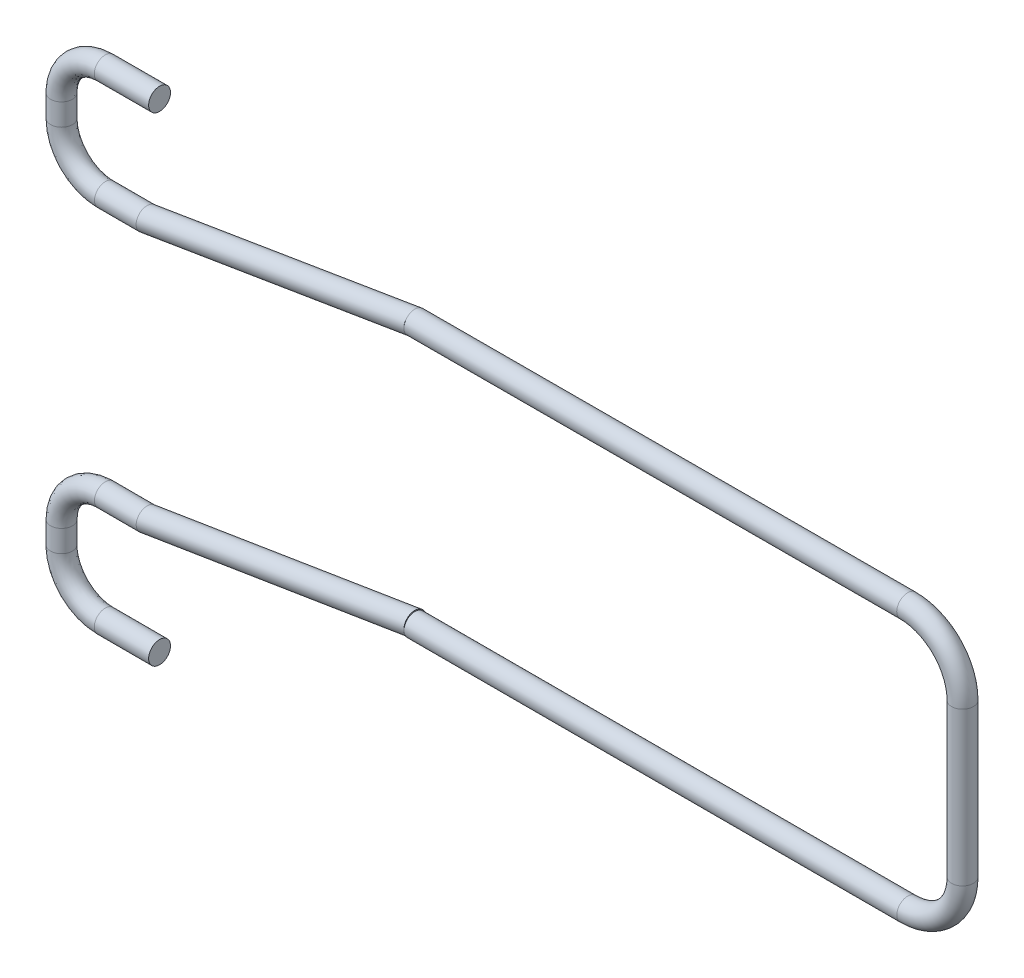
ISO-10303-21;
HEADER;
FILE_DESCRIPTION(('STEP AP214'),'2;1');
FILE_NAME('part.step','',(''),(''),'','','');
FILE_SCHEMA(('AUTOMOTIVE_DESIGN { 1 0 10303 214 1 1 1 1 }'));
ENDSEC;
DATA;
#1=APPLICATION_CONTEXT('core data for automotive mechanical design processes');
#2=APPLICATION_PROTOCOL_DEFINITION('international standard','automotive_design',2000,#1);
#3=PRODUCT_CONTEXT('',#1,'mechanical');
#4=PRODUCT('Part','Part','',(#3));
#5=PRODUCT_RELATED_PRODUCT_CATEGORY('part','',(#4));
#6=PRODUCT_DEFINITION_FORMATION('','',#4);
#7=PRODUCT_DEFINITION_CONTEXT('part definition',#1,'design');
#8=PRODUCT_DEFINITION('design','',#6,#7);
#9=PRODUCT_DEFINITION_SHAPE('','',#8);
#10=(LENGTH_UNIT() NAMED_UNIT(*) SI_UNIT(.MILLI.,.METRE.));
#11=(NAMED_UNIT(*) PLANE_ANGLE_UNIT() SI_UNIT($,.RADIAN.));
#12=(NAMED_UNIT(*) SI_UNIT($,.STERADIAN.) SOLID_ANGLE_UNIT());
#13=UNCERTAINTY_MEASURE_WITH_UNIT(LENGTH_MEASURE(1.E-05),#10,'distance_accuracy_value','');
#14=(GEOMETRIC_REPRESENTATION_CONTEXT(3) GLOBAL_UNCERTAINTY_ASSIGNED_CONTEXT((#13)) GLOBAL_UNIT_ASSIGNED_CONTEXT((#10,
#11,#12)) REPRESENTATION_CONTEXT('',''));
#15=CARTESIAN_POINT('',(0.,0.,0.));
#16=DIRECTION('',(0.,0.,1.));
#17=DIRECTION('',(1.,0.,0.));
#18=AXIS2_PLACEMENT_3D('',#15,#16,#17);
#19=CARTESIAN_POINT('',(-29.0000000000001,-5.99999999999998,0.500000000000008));
#20=DIRECTION('',(1.,0.,0.));
#21=DIRECTION('',(0.,0.,-1.));
#22=AXIS2_PLACEMENT_3D('',#19,#20,#21);
#23=PLANE('',#22);
#24=CARTESIAN_POINT('',(-29.0000000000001,-5.95359360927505,0.504087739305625));
#25=DIRECTION('',(-1.,0.,0.));
#26=DIRECTION('',(0.,0.,-1.));
#27=AXIS2_PLACEMENT_3D('',#24,#25,#26);
#28=CIRCLE('',#27,0.499999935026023);
#29=CARTESIAN_POINT('',(-29.0000000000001,-5.93297077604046,0.00451328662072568));
#30=VERTEX_POINT('',#29);
#31=CARTESIAN_POINT('',(-29.0000000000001,-6.020621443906,0.999574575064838));
#32=VERTEX_POINT('',#31);
#33=EDGE_CURVE('E11',#30,#32,#28,.T.);
#34=ORIENTED_EDGE('',*,*,#33,.F.);
#35=CARTESIAN_POINT('',(-29.0000000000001,-5.99999999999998,0.500000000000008));
#36=DIRECTION('',(1.,0.,0.));
#37=DIRECTION('',(0.,0.,-1.));
#38=AXIS2_PLACEMENT_3D('',#35,#36,#37);
#39=CIRCLE('',#38,0.5);
#40=EDGE_CURVE('E78',#32,#30,#39,.T.);
#41=ORIENTED_EDGE('',*,*,#40,.F.);
#42=EDGE_LOOP('',(#34,#41));
#43=FACE_BOUND('',#42,.T.);
#44=ADVANCED_FACE('F34',(#43),#23,.F.);
#45=CARTESIAN_POINT('',(-41.1295835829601,5.93422779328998,2.50000000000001));
#46=DIRECTION('',(-1.,0.,0.));
#47=DIRECTION('',(0.,0.,-1.));
#48=AXIS2_PLACEMENT_3D('',#45,#46,#47);
#49=CIRCLE('',#48,0.5);
#50=DIRECTION('',(0.999998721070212,0.00159933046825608,0.));
#51=VECTOR('',#50,1.);
#52=SURFACE_OF_LINEAR_EXTRUSION('',#49,#51);
#53=CARTESIAN_POINT('',(-41.1295835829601,5.93422779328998,2.00000000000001));
#54=VERTEX_POINT('',#53);
#55=EDGE_CURVE('E183',#54,#54,#49,.T.);
#56=ORIENTED_EDGE('',*,*,#55,.F.);
#57=EDGE_LOOP('',(#56));
#58=FACE_BOUND('',#57,.T.);
#59=CARTESIAN_POINT('',(-39.2242836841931,5.93724157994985,2.5040877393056));
#60=DIRECTION('',(1.,0.,0.));
#61=DIRECTION('',(0.,0.,-1.));
#62=AXIS2_PLACEMENT_3D('',#59,#60,#61);
#63=CIRCLE('',#62,0.499999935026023);
#64=CARTESIAN_POINT('',(-39.2242836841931,5.93724157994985,2.00408780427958));
#65=VERTEX_POINT('',#64);
#66=EDGE_CURVE('E148',#65,#65,#63,.T.);
#67=ORIENTED_EDGE('',*,*,#66,.F.);
#68=EDGE_LOOP('',(#67));
#69=FACE_BOUND('',#68,.T.);
#70=ADVANCED_FACE('F36',(#58,#69),#52,.F.);
#71=CARTESIAN_POINT('',(-43.132779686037,7.93102657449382,2.5));
#72=DIRECTION('',(0.,1.,0.));
#73=DIRECTION('',(0.,0.,-1.));
#74=AXIS2_PLACEMENT_3D('',#71,#72,#73);
#75=CIRCLE('',#74,0.5);
#76=CARTESIAN_POINT('',(-41.1327822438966,7.93422523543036,2.5));
#77=DIRECTION('',(0.,0.,1.));
#78=AXIS1_PLACEMENT('',#76,#77);
#79=SURFACE_OF_REVOLUTION('',#75,#78);
#80=CARTESIAN_POINT('',(-43.132779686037,7.93102657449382,2.));
#81=VERTEX_POINT('',#80);
#82=EDGE_CURVE('E180',#81,#81,#75,.T.);
#83=ORIENTED_EDGE('',*,*,#82,.F.);
#84=EDGE_LOOP('',(#83));
#85=FACE_BOUND('',#84,.T.);
#86=ORIENTED_EDGE('',*,*,#55,.T.);
#87=EDGE_LOOP('',(#86));
#88=FACE_BOUND('',#87,.T.);
#89=ADVANCED_FACE('F176',(#85,#88),#79,.T.);
#90=CARTESIAN_POINT('',(-43.1343790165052,8.93102529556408,2.50000000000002));
#91=DIRECTION('',(0.,1.,0.));
#92=DIRECTION('',(0.,0.,-1.));
#93=AXIS2_PLACEMENT_3D('',#90,#91,#92);
#94=CIRCLE('',#93,0.5);
#95=DIRECTION('',(0.00159933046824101,-0.999998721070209,0.));
#96=VECTOR('',#95,1.);
#97=SURFACE_OF_LINEAR_EXTRUSION('',#94,#96);
#98=CARTESIAN_POINT('',(-43.1343790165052,8.93102529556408,2.00000000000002));
#99=VERTEX_POINT('',#98);
#100=EDGE_CURVE('E164',#99,#99,#94,.T.);
#101=ORIENTED_EDGE('',*,*,#100,.F.);
#102=EDGE_LOOP('',(#101));
#103=FACE_BOUND('',#102,.T.);
#104=ORIENTED_EDGE('',*,*,#82,.T.);
#105=EDGE_LOOP('',(#104));
#106=FACE_BOUND('',#105,.T.);
#107=ADVANCED_FACE('F173',(#103,#106),#97,.F.);
#108=CARTESIAN_POINT('',(-41.1375802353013,10.9342213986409,2.5));
#109=DIRECTION('',(1.,0.,0.));
#110=DIRECTION('',(0.,0.,-1.));
#111=AXIS2_PLACEMENT_3D('',#108,#109,#110);
#112=CIRCLE('',#111,0.5);
#113=CARTESIAN_POINT('',(-41.1343815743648,8.93422395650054,2.50000000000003));
#114=DIRECTION('',(0.,0.,1.));
#115=AXIS1_PLACEMENT('',#113,#114);
#116=SURFACE_OF_REVOLUTION('',#112,#115);
#117=CARTESIAN_POINT('',(-41.1375802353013,10.9342213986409,2.));
#118=VERTEX_POINT('',#117);
#119=EDGE_CURVE('E160',#118,#118,#112,.T.);
#120=ORIENTED_EDGE('',*,*,#119,.F.);
#121=EDGE_LOOP('',(#120));
#122=FACE_BOUND('',#121,.T.);
#123=ORIENTED_EDGE('',*,*,#100,.T.);
#124=EDGE_LOOP('',(#123));
#125=FACE_BOUND('',#124,.T.);
#126=ADVANCED_FACE('F170',(#122,#125),#116,.T.);
#127=DIRECTION('',(0.999998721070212,0.00159933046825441,0.));
#128=VECTOR('',#127,1.);
#129=SURFACE_OF_LINEAR_EXTRUSION('',#112,#128);
#130=ORIENTED_EDGE('',*,*,#119,.T.);
#131=EDGE_LOOP('',(#130));
#132=FACE_BOUND('',#131,.T.);
#133=CARTESIAN_POINT('',(-38.6567628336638,10.9381890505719,2.49999999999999));
#134=DIRECTION('',(1.,0.,0.));
#135=DIRECTION('',(0.,0.,-1.));
#136=AXIS2_PLACEMENT_3D('',#133,#134,#135);
#137=CIRCLE('',#136,0.5);
#138=CARTESIAN_POINT('',(-38.6567628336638,10.9381890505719,1.99999999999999));
#139=VERTEX_POINT('',#138);
#140=EDGE_CURVE('E152',#139,#139,#137,.T.);
#141=ORIENTED_EDGE('',*,*,#140,.F.);
#142=EDGE_LOOP('',(#141));
#143=FACE_BOUND('',#142,.T.);
#144=ADVANCED_FACE('F168',(#132,#143),#129,.T.);
#145=CARTESIAN_POINT('',(-38.6567628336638,10.9381890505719,2.49999999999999));
#146=DIRECTION('',(1.,0.,0.));
#147=DIRECTION('',(0.,0.,-1.));
#148=AXIS2_PLACEMENT_3D('',#145,#146,#147);
#149=PLANE('',#148);
#150=ORIENTED_EDGE('',*,*,#140,.T.);
#151=EDGE_LOOP('',(#150));
#152=FACE_BOUND('',#151,.T.);
#153=ADVANCED_FACE('F137',(#152),#149,.T.);
#154=CARTESIAN_POINT('',(-39.2242836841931,5.93724157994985,2.5040877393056));
#155=DIRECTION('',(1.,0.,0.));
#156=DIRECTION('',(0.,0.,-1.));
#157=AXIS2_PLACEMENT_3D('',#154,#155,#156);
#158=CIRCLE('',#157,0.499999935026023);
#159=DIRECTION('',(0.981398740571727,0.00156958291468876,-0.191974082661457));
#160=VECTOR('',#159,1.);
#161=SURFACE_OF_LINEAR_EXTRUSION('',#158,#160);
#162=CARTESIAN_POINT('',(-29.0007996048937,6.45358866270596,0.506142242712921));
#163=CARTESIAN_POINT('',(-29.0005330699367,6.45358877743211,0.506167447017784));
#164=CARTESIAN_POINT('',(-29.0002665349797,6.45358889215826,0.506192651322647));
#165=CARTESIAN_POINT('',(-29.0000000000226,6.45358900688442,0.50621785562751));
#166=B_SPLINE_CURVE_WITH_KNOTS('',3,(#162,#163,#164,#165),.UNSPECIFIED.,.F.,.F.,(4,4),(0.,
0.000803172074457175),.UNSPECIFIED.);
#167=CARTESIAN_POINT('',(-29.0007996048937,6.45358866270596,0.506142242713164));
#168=VERTEX_POINT('',#167);
#169=CARTESIAN_POINT('',(-29.,6.45358900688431,0.506217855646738));
#170=VERTEX_POINT('',#169);
#171=EDGE_CURVE('E61',#168,#170,#166,.T.);
#172=ORIENTED_EDGE('',*,*,#171,.F.);
#173=CARTESIAN_POINT('',(-29.0000000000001,5.95362703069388,0.0040878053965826));
#174=CARTESIAN_POINT('',(-29.0000443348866,5.98134789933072,0.00407578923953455));
#175=CARTESIAN_POINT('',(-29.0000886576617,6.00906119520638,0.00641285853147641));
#176=CARTESIAN_POINT('',(-29.0001760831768,6.0637249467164,0.0156214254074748));
#177=CARTESIAN_POINT('',(-29.0002191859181,6.09067540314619,0.0224929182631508));
#178=CARTESIAN_POINT('',(-29.000302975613,6.14306581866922,0.0406065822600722));
#179=CARTESIAN_POINT('',(-29.0003436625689,6.16850577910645,0.0518487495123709));
#180=CARTESIAN_POINT('',(-29.0004215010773,6.21717515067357,0.0783862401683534));
#181=CARTESIAN_POINT('',(-29.000458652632,6.2404045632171,0.0936815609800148));
#182=CARTESIAN_POINT('',(-29.0005283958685,6.28401227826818,0.127905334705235));
#183=CARTESIAN_POINT('',(-29.0005609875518,6.30439058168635,0.146833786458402));
#184=CARTESIAN_POINT('',(-29.000620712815,6.34173445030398,0.187801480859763));
#185=CARTESIAN_POINT('',(-29.0006478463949,6.35870001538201,0.209840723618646));
#186=CARTESIAN_POINT('',(-29.0006959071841,6.38875054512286,0.256422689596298));
#187=CARTESIAN_POINT('',(-29.0007168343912,6.40183550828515,0.280965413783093));
#188=CARTESIAN_POINT('',(-29.0007519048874,6.42376371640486,0.331877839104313));
#189=CARTESIAN_POINT('',(-29.0007660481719,6.43260695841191,0.358247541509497));
#190=CARTESIAN_POINT('',(-29.0007871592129,6.44580686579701,0.412085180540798));
#191=CARTESIAN_POINT('',(-29.0007941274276,6.450163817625,0.439553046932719));
#192=CARTESIAN_POINT('',(-29.0008006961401,6.45427097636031,0.494826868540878));
#193=CARTESIAN_POINT('',(-29.0008002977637,6.45402188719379,0.522632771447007));
#194=CARTESIAN_POINT('',(-29.0007921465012,6.44892522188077,0.577815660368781));
#195=CARTESIAN_POINT('',(-29.0007843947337,6.44407834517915,0.605192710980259));
#196=CARTESIAN_POINT('',(-29.0007617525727,6.4299210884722,0.658763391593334));
#197=CARTESIAN_POINT('',(-29.0007468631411,6.42061130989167,0.684957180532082));
#198=CARTESIAN_POINT('',(-29.0007103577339,6.39778590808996,0.735440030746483));
#199=CARTESIAN_POINT('',(-29.0006887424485,6.38427071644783,0.759729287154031));
#200=CARTESIAN_POINT('',(-29.000639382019,6.35340757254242,0.805734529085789));
#201=CARTESIAN_POINT('',(-29.000611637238,6.3360598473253,0.827450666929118));
#202=CARTESIAN_POINT('',(-29.0005507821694,6.29800955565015,0.867712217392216));
#203=CARTESIAN_POINT('',(-29.000517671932,6.27730702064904,0.886257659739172));
#204=CARTESIAN_POINT('',(-29.0004470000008,6.23311862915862,0.919666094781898));
#205=CARTESIAN_POINT('',(-29.0004094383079,6.20963277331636,0.934529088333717));
#206=CARTESIAN_POINT('',(-29.0003308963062,6.16052353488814,0.960164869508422));
#207=CARTESIAN_POINT('',(-29.0002899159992,6.13490015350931,0.970937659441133));
#208=CARTESIAN_POINT('',(-29.0002083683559,6.08391160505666,0.987541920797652));
#209=CARTESIAN_POINT('',(-29.0001679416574,6.05863437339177,0.9936449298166));
#210=CARTESIAN_POINT('',(-29.000085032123,6.00679428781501,1.00198061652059));
#211=CARTESIAN_POINT('',(-29.0000425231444,5.98021508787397,1.00411172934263));
#212=CARTESIAN_POINT('',(-29.,5.95362703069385,1.00408767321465));
#213=B_SPLINE_CURVE_WITH_KNOTS('',3,(#173,#174,#175,#176,#177,#178,#179,#180,#181,#182,#183,
#184,#185,#186,#187,#188,#189,#190,#191,#192,#193,#194,#195,#196,#197,#198,#199,#200,#201,#202,
#203,#204,#205,#206,#207,#208,#209,#210,#211,#212),.UNSPECIFIED.,.F.,.F.,(4,2,2,2,2,2,2,2,2,2,2,
2,2,2,2,2,2,2,2,4),(0.,0.0830557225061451,0.166111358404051,0.24916692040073,0.332222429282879,
0.415277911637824,0.498333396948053,0.581388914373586,0.664444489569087,0.747494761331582,
0.830532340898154,0.913557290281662,0.996571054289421,1.07957630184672,1.16257663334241,
1.24557618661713,1.32857572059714,1.41157520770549,1.48927626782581,1.56893831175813),.UNSPECIFIED.);
#214=CARTESIAN_POINT('',(-29.0000000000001,5.95362703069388,0.00408780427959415));
#215=VERTEX_POINT('',#214);
#216=EDGE_CURVE('E116',#215,#168,#213,.T.);
#217=ORIENTED_EDGE('',*,*,#216,.F.);
#218=CARTESIAN_POINT('',(-29.,5.95359360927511,0.504087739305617));
#219=DIRECTION('',(1.,0.,0.));
#220=DIRECTION('',(0.,0.,-1.));
#221=AXIS2_PLACEMENT_3D('',#218,#219,#220);
#222=CIRCLE('',#221,0.499999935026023);
#223=EDGE_CURVE('E144',#170,#215,#222,.T.);
#224=ORIENTED_EDGE('',*,*,#223,.F.);
#225=EDGE_LOOP('',(#172,#217,#224));
#226=FACE_BOUND('',#225,.T.);
#227=ORIENTED_EDGE('',*,*,#66,.T.);
#228=EDGE_LOOP('',(#227));
#229=FACE_BOUND('',#228,.T.);
#230=ADVANCED_FACE('F130',(#226,#229),#161,.T.);
#231=CARTESIAN_POINT('',(-29.,5.95359360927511,0.504087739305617));
#232=DIRECTION('',(1.,0.,0.));
#233=DIRECTION('',(0.,0.,-1.));
#234=AXIS2_PLACEMENT_3D('',#231,#232,#233);
#235=PLANE('',#234);
#236=CARTESIAN_POINT('',(-29.,5.95362703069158,0.5));
#237=DIRECTION('',(1.,0.,0.));
#238=DIRECTION('',(0.,-1.,0.));
#239=AXIS2_PLACEMENT_3D('',#236,#237,#238);
#240=ELLIPSE('',#239,0.500000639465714,0.5);
#241=CARTESIAN_POINT('',(-29.,5.95362703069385,1.00000000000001));
#242=VERTEX_POINT('',#241);
#243=EDGE_CURVE('E47',#170,#242,#240,.T.);
#244=ORIENTED_EDGE('',*,*,#243,.F.);
#245=ORIENTED_EDGE('',*,*,#223,.T.);
#246=DIRECTION('',(0.,0.,-1.));
#247=VECTOR('',#246,1.);
#248=CARTESIAN_POINT('',(-29.0000000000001,5.95362703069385,0.504087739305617));
#249=LINE('',#248,#247);
#250=EDGE_CURVE('E187',#242,#215,#249,.T.);
#251=ORIENTED_EDGE('',*,*,#250,.F.);
#252=EDGE_LOOP('',(#244,#245,#251));
#253=FACE_BOUND('',#252,.T.);
#254=ADVANCED_FACE('F136',(#253),#235,.T.);
#255=CARTESIAN_POINT('',(-6.50399832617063,5.98960561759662,0.5));
#256=DIRECTION('',(-0.999998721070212,-0.00159933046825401,0.));
#257=DIRECTION('',(0.00159933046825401,-0.999998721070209,0.));
#258=AXIS2_PLACEMENT_3D('',#255,#256,#257);
#259=CYLINDRICAL_SURFACE('',#258,0.5);
#260=CARTESIAN_POINT('',(-6.50399832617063,5.98960561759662,0.5));
#261=DIRECTION('',(-0.999998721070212,-0.00159933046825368,0.));
#262=DIRECTION('',(0.,0.,-1.));
#263=AXIS2_PLACEMENT_3D('',#260,#261,#262);
#264=CIRCLE('',#263,0.5);
#265=CARTESIAN_POINT('',(-6.50479799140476,6.48960497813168,0.499999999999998));
#266=VERTEX_POINT('',#265);
#267=EDGE_CURVE('E419',#266,#266,#264,.T.);
#268=ORIENTED_EDGE('',*,*,#267,.T.);
#269=EDGE_LOOP('',(#268));
#270=FACE_BOUND('',#269,.T.);
#271=CARTESIAN_POINT('',(-29.,5.95362703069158,0.5));
#272=DIRECTION('',(-0.999998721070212,-0.00159933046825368,0.));
#273=DIRECTION('',(0.,0.,-1.));
#274=AXIS2_PLACEMENT_3D('',#271,#272,#273);
#275=CIRCLE('',#274,0.5);
#276=EDGE_CURVE('E123',#168,#242,#275,.T.);
#277=ORIENTED_EDGE('',*,*,#276,.F.);
#278=ORIENTED_EDGE('',*,*,#171,.T.);
#279=ORIENTED_EDGE('',*,*,#243,.T.);
#280=EDGE_LOOP('',(#277,#278,#279));
#281=FACE_BOUND('',#280,.T.);
#282=ADVANCED_FACE('F306',(#270,#281),#259,.T.);
#283=CARTESIAN_POINT('',(-6.49999999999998,3.48960881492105,0.500000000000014));
#284=DIRECTION('',(0.,0.,1.));
#285=DIRECTION('',(1.,0.,0.));
#286=AXIS2_PLACEMENT_3D('',#283,#284,#285);
#287=TOROIDAL_SURFACE('',#286,2.5,0.5);
#288=CARTESIAN_POINT('',(-4.00000000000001,3.48960881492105,0.500000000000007));
#289=DIRECTION('',(0.,1.,0.));
#290=DIRECTION('',(0.,0.,-1.));
#291=AXIS2_PLACEMENT_3D('',#288,#289,#290);
#292=CIRCLE('',#291,0.5);
#293=CARTESIAN_POINT('',(-3.49999999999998,3.48960881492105,0.500000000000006));
#294=VERTEX_POINT('',#293);
#295=EDGE_CURVE('E421',#294,#294,#292,.T.);
#296=CARTESIAN_POINT('',(-6.49999999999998,3.48960881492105,0.500000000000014));
#297=DIRECTION('',(0.,0.,1.));
#298=DIRECTION('',(1.,0.,0.));
#299=AXIS2_PLACEMENT_3D('',#296,#297,#298);
#300=CIRCLE('',#299,3.);
#301=EDGE_CURVE('',#294,#266,#300,.T.);
#302=ORIENTED_EDGE('',*,*,#295,.T.);
#303=ORIENTED_EDGE('',*,*,#267,.F.);
#304=ORIENTED_EDGE('',*,*,#301,.T.);
#305=ORIENTED_EDGE('',*,*,#301,.F.);
#306=EDGE_LOOP('',(#302,#304,#303,#305));
#307=FACE_BOUND('',#306,.T.);
#308=ADVANCED_FACE('F298',(#307),#287,.T.);
#309=CARTESIAN_POINT('',(-3.99999999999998,-3.49999999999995,0.499999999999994));
#310=DIRECTION('',(0.,1.,0.));
#311=DIRECTION('',(0.,0.,1.));
#312=AXIS2_PLACEMENT_3D('',#309,#310,#311);
#313=CYLINDRICAL_SURFACE('',#312,0.5);
#314=CARTESIAN_POINT('',(-3.99999999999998,-3.49999999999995,0.499999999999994));
#315=DIRECTION('',(0.,1.,0.));
#316=DIRECTION('',(0.,0.,-1.));
#317=AXIS2_PLACEMENT_3D('',#314,#315,#316);
#318=CIRCLE('',#317,0.5);
#319=CARTESIAN_POINT('',(-3.50000000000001,-3.49999999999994,0.499999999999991));
#320=VERTEX_POINT('',#319);
#321=EDGE_CURVE('E424',#320,#320,#318,.T.);
#322=ORIENTED_EDGE('',*,*,#321,.T.);
#323=EDGE_LOOP('',(#322));
#324=FACE_BOUND('',#323,.T.);
#325=ORIENTED_EDGE('',*,*,#295,.F.);
#326=EDGE_LOOP('',(#325));
#327=FACE_BOUND('',#326,.T.);
#328=ADVANCED_FACE('F291',(#324,#327),#313,.T.);
#329=CARTESIAN_POINT('',(-6.50000000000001,-3.49999999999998,0.500000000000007));
#330=DIRECTION('',(0.,0.,1.));
#331=DIRECTION('',(1.,0.,0.));
#332=AXIS2_PLACEMENT_3D('',#329,#330,#331);
#333=TOROIDAL_SURFACE('',#332,2.5,0.5);
#334=CARTESIAN_POINT('',(-6.50000000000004,-6.00000000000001,0.500000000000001));
#335=DIRECTION('',(1.,0.,0.));
#336=DIRECTION('',(0.,0.,-1.));
#337=AXIS2_PLACEMENT_3D('',#334,#335,#336);
#338=CIRCLE('',#337,0.5);
#339=CARTESIAN_POINT('',(-6.50000000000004,-6.49999999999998,0.5));
#340=VERTEX_POINT('',#339);
#341=EDGE_CURVE('E82',#340,#340,#338,.T.);
#342=CARTESIAN_POINT('',(-6.50000000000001,-3.49999999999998,0.500000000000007));
#343=DIRECTION('',(0.,0.,1.));
#344=DIRECTION('',(1.,0.,0.));
#345=AXIS2_PLACEMENT_3D('',#342,#343,#344);
#346=CIRCLE('',#345,3.);
#347=EDGE_CURVE('',#340,#320,#346,.T.);
#348=ORIENTED_EDGE('',*,*,#341,.T.);
#349=ORIENTED_EDGE('',*,*,#321,.F.);
#350=ORIENTED_EDGE('',*,*,#347,.T.);
#351=ORIENTED_EDGE('',*,*,#347,.F.);
#352=EDGE_LOOP('',(#348,#350,#349,#351));
#353=FACE_BOUND('',#352,.T.);
#354=ADVANCED_FACE('F284',(#353),#333,.T.);
#355=CARTESIAN_POINT('',(-6.50000000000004,-6.00000000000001,0.500000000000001));
#356=DIRECTION('',(-1.,0.,0.));
#357=DIRECTION('',(0.,0.,1.));
#358=AXIS2_PLACEMENT_3D('',#355,#356,#357);
#359=CYLINDRICAL_SURFACE('',#358,0.5);
#360=ORIENTED_EDGE('',*,*,#341,.F.);
#361=EDGE_LOOP('',(#360));
#362=FACE_BOUND('',#361,.T.);
#363=EDGE_CURVE('E76',#30,#32,#39,.T.);
#364=ORIENTED_EDGE('',*,*,#363,.T.);
#365=ORIENTED_EDGE('',*,*,#40,.T.);
#366=EDGE_LOOP('',(#364,#365));
#367=FACE_BOUND('',#366,.T.);
#368=ADVANCED_FACE('F77',(#362,#367),#359,.T.);
#369=CARTESIAN_POINT('',(-29.,5.95362703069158,0.5));
#370=DIRECTION('',(-0.999998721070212,-0.00159933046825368,0.));
#371=DIRECTION('',(0.,0.,-1.));
#372=AXIS2_PLACEMENT_3D('',#369,#370,#371);
#373=PLANE('',#372);
#374=ORIENTED_EDGE('',*,*,#250,.T.);
#375=ORIENTED_EDGE('',*,*,#216,.T.);
#376=ORIENTED_EDGE('',*,*,#276,.T.);
#377=EDGE_LOOP('',(#374,#375,#376));
#378=FACE_BOUND('',#377,.T.);
#379=ADVANCED_FACE('F109',(#378),#373,.T.);
#380=CARTESIAN_POINT('',(-29.0000000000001,-5.95359360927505,0.504087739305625));
#381=DIRECTION('',(1.,0.,0.));
#382=DIRECTION('',(0.,0.,-1.));
#383=AXIS2_PLACEMENT_3D('',#380,#381,#382);
#384=PLANE('',#383);
#385=ORIENTED_EDGE('',*,*,#363,.F.);
#386=EDGE_CURVE('E49',#32,#30,#28,.T.);
#387=ORIENTED_EDGE('',*,*,#386,.F.);
#388=EDGE_LOOP('',(#385,#387));
#389=FACE_BOUND('',#388,.T.);
#390=ADVANCED_FACE('F87',(#389),#384,.T.);
#391=CARTESIAN_POINT('',(-39.2242836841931,-5.93724157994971,2.50408773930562));
#392=DIRECTION('',(-1.,0.,0.));
#393=DIRECTION('',(0.,0.,-1.));
#394=AXIS2_PLACEMENT_3D('',#391,#392,#393);
#395=CIRCLE('',#394,0.499999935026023);
#396=DIRECTION('',(0.981398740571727,-0.00156958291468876,-0.191974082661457));
#397=VECTOR('',#396,1.);
#398=SURFACE_OF_LINEAR_EXTRUSION('',#395,#397);
#399=CARTESIAN_POINT('',(-39.2242836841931,-5.93727500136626,2.50000000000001));
#400=DIRECTION('',(-1.,0.,0.));
#401=DIRECTION('',(0.,0.,-1.));
#402=AXIS2_PLACEMENT_3D('',#399,#400,#401);
#403=CIRCLE('',#402,0.5);
#404=CARTESIAN_POINT('',(-39.2242836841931,-5.93727500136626,2.00000000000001));
#405=VERTEX_POINT('',#404);
#406=EDGE_CURVE('E84',#405,#405,#403,.T.);
#407=ORIENTED_EDGE('',*,*,#406,.F.);
#408=EDGE_LOOP('',(#407));
#409=FACE_BOUND('',#408,.T.);
#410=ORIENTED_EDGE('',*,*,#386,.T.);
#411=ORIENTED_EDGE('',*,*,#33,.T.);
#412=EDGE_LOOP('',(#410,#411));
#413=FACE_BOUND('',#412,.T.);
#414=ADVANCED_FACE('F86',(#409,#413),#398,.F.);
#415=CARTESIAN_POINT('',(-41.12958358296,-5.93422779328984,2.50000000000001));
#416=DIRECTION('',(1.,0.,0.));
#417=DIRECTION('',(0.,0.,-1.));
#418=AXIS2_PLACEMENT_3D('',#415,#416,#417);
#419=CIRCLE('',#418,0.5);
#420=DIRECTION('',(0.999998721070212,-0.00159933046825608,0.));
#421=VECTOR('',#420,1.);
#422=SURFACE_OF_LINEAR_EXTRUSION('',#419,#421);
#423=CARTESIAN_POINT('',(-41.12958358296,-5.93422779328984,2.00000000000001));
#424=VERTEX_POINT('',#423);
#425=EDGE_CURVE('E88',#424,#424,#419,.T.);
#426=ORIENTED_EDGE('',*,*,#425,.T.);
#427=EDGE_LOOP('',(#426));
#428=FACE_BOUND('',#427,.T.);
#429=ORIENTED_EDGE('',*,*,#406,.T.);
#430=EDGE_LOOP('',(#429));
#431=FACE_BOUND('',#430,.T.);
#432=ADVANCED_FACE('F105',(#428,#431),#422,.T.);
#433=CARTESIAN_POINT('',(-43.132779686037,-7.93102657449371,2.50000000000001));
#434=DIRECTION('',(0.,1.,0.));
#435=DIRECTION('',(0.,0.,-1.));
#436=AXIS2_PLACEMENT_3D('',#433,#434,#435);
#437=CIRCLE('',#436,0.5);
#438=CARTESIAN_POINT('',(-41.1327822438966,-7.93422523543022,2.5));
#439=DIRECTION('',(0.,0.,-1.));
#440=AXIS1_PLACEMENT('',#438,#439);
#441=SURFACE_OF_REVOLUTION('',#437,#440);
#442=CARTESIAN_POINT('',(-43.132779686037,-7.93102657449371,2.00000000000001));
#443=VERTEX_POINT('',#442);
#444=EDGE_CURVE('E91',#443,#443,#437,.T.);
#445=ORIENTED_EDGE('',*,*,#444,.T.);
#446=EDGE_LOOP('',(#445));
#447=FACE_BOUND('',#446,.T.);
#448=ORIENTED_EDGE('',*,*,#425,.F.);
#449=EDGE_LOOP('',(#448));
#450=FACE_BOUND('',#449,.T.);
#451=ADVANCED_FACE('F210',(#447,#450),#441,.F.);
#452=CARTESIAN_POINT('',(-43.1343790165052,-8.93102529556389,2.50000000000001));
#453=DIRECTION('',(0.,1.,0.));
#454=DIRECTION('',(0.,0.,-1.));
#455=AXIS2_PLACEMENT_3D('',#452,#453,#454);
#456=CIRCLE('',#455,0.5);
#457=DIRECTION('',(0.00159933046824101,0.999998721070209,0.));
#458=VECTOR('',#457,1.);
#459=SURFACE_OF_LINEAR_EXTRUSION('',#456,#458);
#460=CARTESIAN_POINT('',(-43.1343790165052,-8.93102529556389,2.00000000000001));
#461=VERTEX_POINT('',#460);
#462=EDGE_CURVE('E222',#461,#461,#456,.T.);
#463=ORIENTED_EDGE('',*,*,#462,.T.);
#464=EDGE_LOOP('',(#463));
#465=FACE_BOUND('',#464,.T.);
#466=ORIENTED_EDGE('',*,*,#444,.F.);
#467=EDGE_LOOP('',(#466));
#468=FACE_BOUND('',#467,.T.);
#469=ADVANCED_FACE('F214',(#465,#468),#459,.T.);
#470=CARTESIAN_POINT('',(-41.1375802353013,-10.9342213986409,2.50000000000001));
#471=DIRECTION('',(-1.,0.,0.));
#472=DIRECTION('',(0.,0.,-1.));
#473=AXIS2_PLACEMENT_3D('',#470,#471,#472);
#474=CIRCLE('',#473,0.5);
#475=CARTESIAN_POINT('',(-41.1343815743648,-8.9342239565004,2.50000000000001));
#476=DIRECTION('',(0.,0.,-1.));
#477=AXIS1_PLACEMENT('',#475,#476);
#478=SURFACE_OF_REVOLUTION('',#474,#477);
#479=CARTESIAN_POINT('',(-41.1375802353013,-10.9342213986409,2.00000000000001));
#480=VERTEX_POINT('',#479);
#481=EDGE_CURVE('E225',#480,#480,#474,.T.);
#482=ORIENTED_EDGE('',*,*,#481,.T.);
#483=EDGE_LOOP('',(#482));
#484=FACE_BOUND('',#483,.T.);
#485=ORIENTED_EDGE('',*,*,#462,.F.);
#486=EDGE_LOOP('',(#485));
#487=FACE_BOUND('',#486,.T.);
#488=ADVANCED_FACE('F218',(#484,#487),#478,.F.);
#489=DIRECTION('',(0.999998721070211,-0.00159933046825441,0.));
#490=VECTOR('',#489,1.);
#491=SURFACE_OF_LINEAR_EXTRUSION('',#474,#490);
#492=ORIENTED_EDGE('',*,*,#481,.F.);
#493=EDGE_LOOP('',(#492));
#494=FACE_BOUND('',#493,.T.);
#495=CARTESIAN_POINT('',(-38.6567628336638,-10.9381890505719,2.50000000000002));
#496=DIRECTION('',(-1.,0.,0.));
#497=DIRECTION('',(0.,0.,-1.));
#498=AXIS2_PLACEMENT_3D('',#495,#496,#497);
#499=CIRCLE('',#498,0.5);
#500=CARTESIAN_POINT('',(-38.6567628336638,-10.9381890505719,2.00000000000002));
#501=VERTEX_POINT('',#500);
#502=EDGE_CURVE('E229',#501,#501,#499,.T.);
#503=ORIENTED_EDGE('',*,*,#502,.T.);
#504=EDGE_LOOP('',(#503));
#505=FACE_BOUND('',#504,.T.);
#506=ADVANCED_FACE('F231',(#494,#505),#491,.F.);
#507=CARTESIAN_POINT('',(-38.6567628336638,-10.9381890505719,2.50000000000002));
#508=DIRECTION('',(1.,0.,0.));
#509=DIRECTION('',(0.,0.,-1.));
#510=AXIS2_PLACEMENT_3D('',#507,#508,#509);
#511=PLANE('',#510);
#512=ORIENTED_EDGE('',*,*,#502,.F.);
#513=EDGE_LOOP('',(#512));
#514=FACE_BOUND('',#513,.T.);
#515=ADVANCED_FACE('F234',(#514),#511,.T.);
#516=CLOSED_SHELL('',(#44,#70,#89,#107,#126,#144,#153,#230,#254,#282,#308,#328,#354,#368,#379,
#390,#414,#432,#451,#469,#488,#506,#515));
#517=MANIFOLD_SOLID_BREP('B2',#516);
#518=ADVANCED_BREP_SHAPE_REPRESENTATION('',(#18,#517),#14);
#519=SHAPE_DEFINITION_REPRESENTATION(#9,#518);
ENDSEC;
END-ISO-10303-21;
